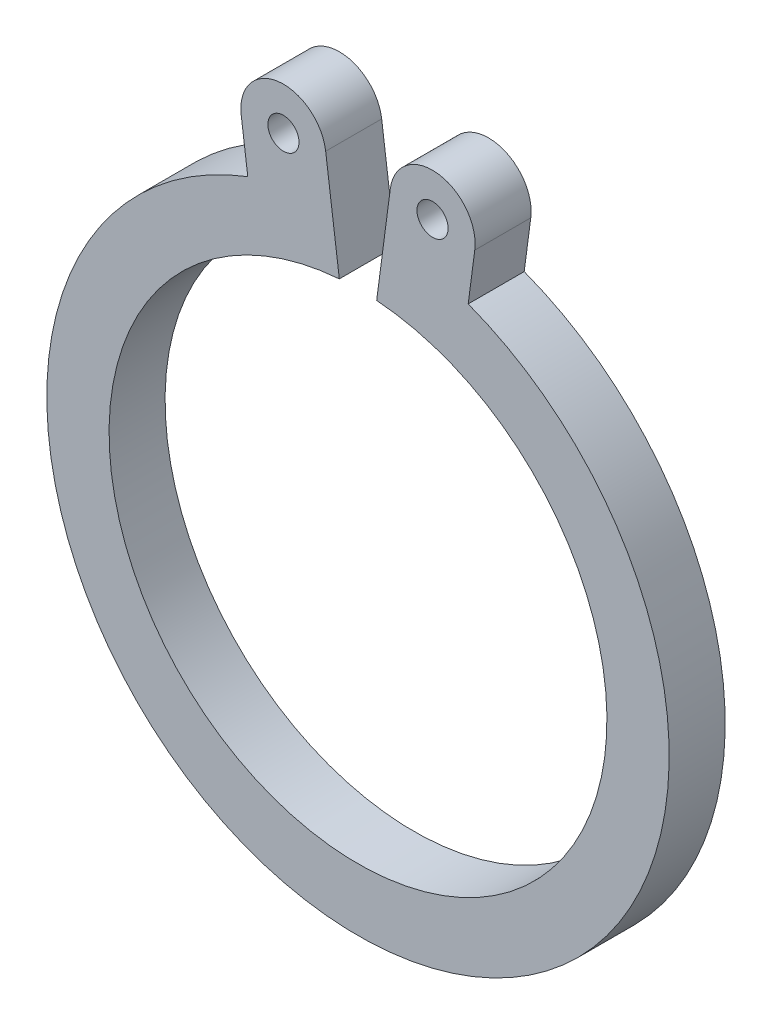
ISO-10303-21;
HEADER;
FILE_DESCRIPTION(('STEP AP214'),'2;1');
FILE_NAME('part.step','',(''),(''),'','','');
FILE_SCHEMA(('AUTOMOTIVE_DESIGN { 1 0 10303 214 1 1 1 1 }'));
ENDSEC;
DATA;
#1=APPLICATION_CONTEXT('core data for automotive mechanical design processes');
#2=APPLICATION_PROTOCOL_DEFINITION('international standard','automotive_design',2000,#1);
#3=PRODUCT_CONTEXT('',#1,'mechanical');
#4=PRODUCT('Part','Part','',(#3));
#5=PRODUCT_RELATED_PRODUCT_CATEGORY('part','',(#4));
#6=PRODUCT_DEFINITION_FORMATION('','',#4);
#7=PRODUCT_DEFINITION_CONTEXT('part definition',#1,'design');
#8=PRODUCT_DEFINITION('design','',#6,#7);
#9=PRODUCT_DEFINITION_SHAPE('','',#8);
#10=(LENGTH_UNIT() NAMED_UNIT(*) SI_UNIT(.MILLI.,.METRE.));
#11=(NAMED_UNIT(*) PLANE_ANGLE_UNIT() SI_UNIT($,.RADIAN.));
#12=(NAMED_UNIT(*) SI_UNIT($,.STERADIAN.) SOLID_ANGLE_UNIT());
#13=UNCERTAINTY_MEASURE_WITH_UNIT(LENGTH_MEASURE(1.E-05),#10,'distance_accuracy_value','');
#14=(GEOMETRIC_REPRESENTATION_CONTEXT(3) GLOBAL_UNCERTAINTY_ASSIGNED_CONTEXT((#13)) GLOBAL_UNIT_ASSIGNED_CONTEXT((#10,
#11,#12)) REPRESENTATION_CONTEXT('',''));
#15=CARTESIAN_POINT('',(0.,0.,0.));
#16=DIRECTION('',(0.,0.,1.));
#17=DIRECTION('',(1.,0.,0.));
#18=AXIS2_PLACEMENT_3D('',#15,#16,#17);
#19=CARTESIAN_POINT('',(1.19779655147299,5.56614903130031,0.9));
#20=DIRECTION('',(0.,0.,1.));
#21=DIRECTION('',(1.,0.,0.));
#22=AXIS2_PLACEMENT_3D('',#19,#20,#21);
#23=PLANE('',#22);
#24=CARTESIAN_POINT('',(1.19779655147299,5.56614903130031,0.9));
#25=DIRECTION('',(0.,0.,1.));
#26=DIRECTION('',(1.,0.,0.));
#27=AXIS2_PLACEMENT_3D('',#24,#25,#26);
#28=CIRCLE('',#27,0.25);
#29=CARTESIAN_POINT('',(1.44779655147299,5.56614903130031,0.9));
#30=VERTEX_POINT('',#29);
#31=EDGE_CURVE('E103',#30,#30,#28,.T.);
#32=ORIENTED_EDGE('',*,*,#31,.F.);
#33=EDGE_LOOP('',(#32));
#34=FACE_BOUND('',#33,.T.);
#35=CARTESIAN_POINT('',(1.19779655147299,5.56614903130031,0.9));
#36=DIRECTION('',(0.,0.,1.));
#37=DIRECTION('',(1.,0.,0.));
#38=AXIS2_PLACEMENT_3D('',#35,#36,#37);
#39=CIRCLE('',#38,0.68422181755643);
#40=CARTESIAN_POINT('',(1.87616475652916,5.47684016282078,0.9));
#41=VERTEX_POINT('',#40);
#42=CARTESIAN_POINT('',(0.519428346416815,5.65545789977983,0.9));
#43=VERTEX_POINT('',#42);
#44=EDGE_CURVE('E126',#41,#43,#39,.T.);
#45=ORIENTED_EDGE('',*,*,#44,.T.);
#46=DIRECTION('',(-0.130526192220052,-0.99144486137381,0.));
#47=VECTOR('',#46,1.);
#48=CARTESIAN_POINT('',(0.519428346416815,5.65545789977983,0.9));
#49=LINE('',#48,#47);
#50=CARTESIAN_POINT('',(0.3,3.98873413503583,0.9));
#51=VERTEX_POINT('',#50);
#52=EDGE_CURVE('E95',#43,#51,#49,.T.);
#53=ORIENTED_EDGE('',*,*,#52,.T.);
#54=CARTESIAN_POINT('',(0.,0.,0.9));
#55=DIRECTION('',(0.,0.,1.));
#56=DIRECTION('',(1.,0.,0.));
#57=AXIS2_PLACEMENT_3D('',#54,#55,#56);
#58=CIRCLE('',#57,4.);
#59=CARTESIAN_POINT('',(-0.3,3.98873413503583,0.9));
#60=VERTEX_POINT('',#59);
#61=EDGE_CURVE('E129',#60,#51,#58,.T.);
#62=ORIENTED_EDGE('',*,*,#61,.F.);
#63=DIRECTION('',(0.130526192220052,-0.99144486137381,0.));
#64=VECTOR('',#63,1.);
#65=CARTESIAN_POINT('',(-0.519428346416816,5.65545789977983,0.9));
#66=LINE('',#65,#64);
#67=CARTESIAN_POINT('',(-0.519428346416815,5.65545789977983,0.9));
#68=VERTEX_POINT('',#67);
#69=EDGE_CURVE('E132',#68,#60,#66,.T.);
#70=ORIENTED_EDGE('',*,*,#69,.F.);
#71=CARTESIAN_POINT('',(-1.19779655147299,5.56614903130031,0.9));
#72=DIRECTION('',(0.,0.,1.));
#73=DIRECTION('',(1.,0.,0.));
#74=AXIS2_PLACEMENT_3D('',#71,#72,#73);
#75=CIRCLE('',#74,0.68422181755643);
#76=CARTESIAN_POINT('',(-1.87616475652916,5.47684016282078,0.9));
#77=VERTEX_POINT('',#76);
#78=EDGE_CURVE('E135',#68,#77,#75,.T.);
#79=ORIENTED_EDGE('',*,*,#78,.T.);
#80=DIRECTION('',(-0.130526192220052,0.99144486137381,0.));
#81=VECTOR('',#80,1.);
#82=CARTESIAN_POINT('',(-1.77072586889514,4.67595229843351,0.9));
#83=LINE('',#82,#81);
#84=CARTESIAN_POINT('',(-1.77072586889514,4.67595229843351,0.9));
#85=VERTEX_POINT('',#84);
#86=EDGE_CURVE('E138',#85,#77,#83,.T.);
#87=ORIENTED_EDGE('',*,*,#86,.F.);
#88=CARTESIAN_POINT('',(0.,0.,0.9));
#89=DIRECTION('',(0.,0.,1.));
#90=DIRECTION('',(1.,0.,0.));
#91=AXIS2_PLACEMENT_3D('',#88,#89,#90);
#92=CIRCLE('',#91,5.00000000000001);
#93=CARTESIAN_POINT('',(1.77072586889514,4.67595229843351,0.9));
#94=VERTEX_POINT('',#93);
#95=EDGE_CURVE('E141',#85,#94,#92,.T.);
#96=ORIENTED_EDGE('',*,*,#95,.T.);
#97=DIRECTION('',(0.130526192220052,0.99144486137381,0.));
#98=VECTOR('',#97,1.);
#99=CARTESIAN_POINT('',(1.77072586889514,4.67595229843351,0.9));
#100=LINE('',#99,#98);
#101=EDGE_CURVE('E143',#94,#41,#100,.T.);
#102=ORIENTED_EDGE('',*,*,#101,.T.);
#103=EDGE_LOOP('',(#45,#53,#62,#70,#79,#87,#96,#102));
#104=FACE_BOUND('',#103,.T.);
#105=CARTESIAN_POINT('',(-1.19779655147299,5.56614903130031,0.9));
#106=DIRECTION('',(0.,0.,1.));
#107=DIRECTION('',(1.,0.,0.));
#108=AXIS2_PLACEMENT_3D('',#105,#106,#107);
#109=CIRCLE('',#108,0.25);
#110=CARTESIAN_POINT('',(-0.947796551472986,5.56614903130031,0.9));
#111=VERTEX_POINT('',#110);
#112=EDGE_CURVE('E232',#111,#111,#109,.T.);
#113=ORIENTED_EDGE('',*,*,#112,.F.);
#114=EDGE_LOOP('',(#113));
#115=FACE_BOUND('',#114,.T.);
#116=ADVANCED_FACE('F24',(#34,#104,#115),#23,.T.);
#117=CARTESIAN_POINT('',(1.19779655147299,5.56614903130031,0.));
#118=DIRECTION('',(0.,0.,1.));
#119=DIRECTION('',(1.,0.,0.));
#120=AXIS2_PLACEMENT_3D('',#117,#118,#119);
#121=PLANE('',#120);
#122=CARTESIAN_POINT('',(1.19779655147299,5.56614903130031,0.));
#123=DIRECTION('',(0.,0.,1.));
#124=DIRECTION('',(1.,0.,0.));
#125=AXIS2_PLACEMENT_3D('',#122,#123,#124);
#126=CIRCLE('',#125,0.25);
#127=CARTESIAN_POINT('',(1.44779655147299,5.56614903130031,0.));
#128=VERTEX_POINT('',#127);
#129=EDGE_CURVE('E237',#128,#128,#126,.T.);
#130=ORIENTED_EDGE('',*,*,#129,.T.);
#131=EDGE_LOOP('',(#130));
#132=FACE_BOUND('',#131,.T.);
#133=CARTESIAN_POINT('',(1.19779655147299,5.56614903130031,0.));
#134=DIRECTION('',(0.,0.,1.));
#135=DIRECTION('',(1.,0.,0.));
#136=AXIS2_PLACEMENT_3D('',#133,#134,#135);
#137=CIRCLE('',#136,0.68422181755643);
#138=CARTESIAN_POINT('',(1.87616475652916,5.47684016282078,0.));
#139=VERTEX_POINT('',#138);
#140=CARTESIAN_POINT('',(0.519428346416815,5.65545789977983,0.));
#141=VERTEX_POINT('',#140);
#142=EDGE_CURVE('E99',#139,#141,#137,.T.);
#143=ORIENTED_EDGE('',*,*,#142,.F.);
#144=DIRECTION('',(0.130526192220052,0.99144486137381,0.));
#145=VECTOR('',#144,1.);
#146=CARTESIAN_POINT('',(1.77072586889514,4.67595229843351,0.));
#147=LINE('',#146,#145);
#148=CARTESIAN_POINT('',(1.77072586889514,4.67595229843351,0.));
#149=VERTEX_POINT('',#148);
#150=EDGE_CURVE('E124',#149,#139,#147,.T.);
#151=ORIENTED_EDGE('',*,*,#150,.F.);
#152=CARTESIAN_POINT('',(0.,0.,0.));
#153=DIRECTION('',(0.,0.,1.));
#154=DIRECTION('',(1.,0.,0.));
#155=AXIS2_PLACEMENT_3D('',#152,#153,#154);
#156=CIRCLE('',#155,5.00000000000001);
#157=CARTESIAN_POINT('',(-1.77072586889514,4.67595229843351,0.));
#158=VERTEX_POINT('',#157);
#159=EDGE_CURVE('E122',#158,#149,#156,.T.);
#160=ORIENTED_EDGE('',*,*,#159,.F.);
#161=DIRECTION('',(-0.130526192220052,0.99144486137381,0.));
#162=VECTOR('',#161,1.);
#163=CARTESIAN_POINT('',(-1.77072586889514,4.67595229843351,0.));
#164=LINE('',#163,#162);
#165=CARTESIAN_POINT('',(-1.87616475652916,5.47684016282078,0.));
#166=VERTEX_POINT('',#165);
#167=EDGE_CURVE('E119',#158,#166,#164,.T.);
#168=ORIENTED_EDGE('',*,*,#167,.T.);
#169=CARTESIAN_POINT('',(-1.19779655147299,5.56614903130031,0.));
#170=DIRECTION('',(0.,0.,1.));
#171=DIRECTION('',(1.,0.,0.));
#172=AXIS2_PLACEMENT_3D('',#169,#170,#171);
#173=CIRCLE('',#172,0.68422181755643);
#174=CARTESIAN_POINT('',(-0.519428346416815,5.65545789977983,0.));
#175=VERTEX_POINT('',#174);
#176=EDGE_CURVE('E116',#175,#166,#173,.T.);
#177=ORIENTED_EDGE('',*,*,#176,.F.);
#178=DIRECTION('',(0.130526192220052,-0.99144486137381,0.));
#179=VECTOR('',#178,1.);
#180=CARTESIAN_POINT('',(-0.519428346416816,5.65545789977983,0.));
#181=LINE('',#180,#179);
#182=CARTESIAN_POINT('',(-0.3,3.98873413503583,0.));
#183=VERTEX_POINT('',#182);
#184=EDGE_CURVE('E111',#175,#183,#181,.T.);
#185=ORIENTED_EDGE('',*,*,#184,.T.);
#186=CARTESIAN_POINT('',(0.,0.,0.));
#187=DIRECTION('',(0.,0.,1.));
#188=DIRECTION('',(1.,0.,0.));
#189=AXIS2_PLACEMENT_3D('',#186,#187,#188);
#190=CIRCLE('',#189,4.);
#191=CARTESIAN_POINT('',(0.3,3.98873413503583,0.));
#192=VERTEX_POINT('',#191);
#193=EDGE_CURVE('E109',#183,#192,#190,.T.);
#194=ORIENTED_EDGE('',*,*,#193,.T.);
#195=DIRECTION('',(-0.130526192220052,-0.99144486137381,0.));
#196=VECTOR('',#195,1.);
#197=CARTESIAN_POINT('',(0.519428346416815,5.65545789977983,0.));
#198=LINE('',#197,#196);
#199=EDGE_CURVE('E92',#141,#192,#198,.T.);
#200=ORIENTED_EDGE('',*,*,#199,.F.);
#201=EDGE_LOOP('',(#143,#151,#160,#168,#177,#185,#194,#200));
#202=FACE_BOUND('',#201,.T.);
#203=CARTESIAN_POINT('',(-1.19779655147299,5.56614903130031,0.));
#204=DIRECTION('',(0.,0.,1.));
#205=DIRECTION('',(1.,0.,0.));
#206=AXIS2_PLACEMENT_3D('',#203,#204,#205);
#207=CIRCLE('',#206,0.25);
#208=CARTESIAN_POINT('',(-0.947796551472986,5.56614903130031,0.));
#209=VERTEX_POINT('',#208);
#210=EDGE_CURVE('E235',#209,#209,#207,.T.);
#211=ORIENTED_EDGE('',*,*,#210,.T.);
#212=EDGE_LOOP('',(#211));
#213=FACE_BOUND('',#212,.T.);
#214=ADVANCED_FACE('F105',(#132,#202,#213),#121,.F.);
#215=CARTESIAN_POINT('',(1.19779655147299,5.56614903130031,0.9));
#216=DIRECTION('',(0.,0.,-1.));
#217=DIRECTION('',(-1.,0.,0.));
#218=AXIS2_PLACEMENT_3D('',#215,#216,#217);
#219=CYLINDRICAL_SURFACE('',#218,0.68422181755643);
#220=DIRECTION('',(0.,0.,-1.));
#221=VECTOR('',#220,1.);
#222=CARTESIAN_POINT('',(0.519428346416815,5.65545789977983,0.9));
#223=LINE('',#222,#221);
#224=EDGE_CURVE('E11',#43,#141,#223,.T.);
#225=ORIENTED_EDGE('',*,*,#224,.F.);
#226=ORIENTED_EDGE('',*,*,#44,.F.);
#227=DIRECTION('',(0.,0.,-1.));
#228=VECTOR('',#227,1.);
#229=CARTESIAN_POINT('',(1.87616475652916,5.47684016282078,0.9));
#230=LINE('',#229,#228);
#231=EDGE_CURVE('E39',#41,#139,#230,.T.);
#232=ORIENTED_EDGE('',*,*,#231,.T.);
#233=ORIENTED_EDGE('',*,*,#142,.T.);
#234=EDGE_LOOP('',(#225,#226,#232,#233));
#235=FACE_BOUND('',#234,.T.);
#236=ADVANCED_FACE('F100',(#235),#219,.T.);
#237=CARTESIAN_POINT('',(0.519428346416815,5.65545789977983,0.9));
#238=DIRECTION('',(0.99144486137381,-0.130526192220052,0.));
#239=DIRECTION('',(0.130526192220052,0.99144486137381,0.));
#240=AXIS2_PLACEMENT_3D('',#237,#238,#239);
#241=PLANE('',#240);
#242=DIRECTION('',(0.,0.,-1.));
#243=VECTOR('',#242,1.);
#244=CARTESIAN_POINT('',(0.3,3.98873413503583,0.9));
#245=LINE('',#244,#243);
#246=EDGE_CURVE('E32',#51,#192,#245,.T.);
#247=ORIENTED_EDGE('',*,*,#246,.F.);
#248=ORIENTED_EDGE('',*,*,#52,.F.);
#249=ORIENTED_EDGE('',*,*,#224,.T.);
#250=ORIENTED_EDGE('',*,*,#199,.T.);
#251=EDGE_LOOP('',(#247,#248,#249,#250));
#252=FACE_BOUND('',#251,.T.);
#253=ADVANCED_FACE('F26',(#252),#241,.F.);
#254=CARTESIAN_POINT('',(0.,0.,0.9));
#255=DIRECTION('',(0.,0.,-1.));
#256=DIRECTION('',(-1.,0.,0.));
#257=AXIS2_PLACEMENT_3D('',#254,#255,#256);
#258=CYLINDRICAL_SURFACE('',#257,4.);
#259=DIRECTION('',(0.,0.,-1.));
#260=VECTOR('',#259,1.);
#261=CARTESIAN_POINT('',(-0.3,3.98873413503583,0.9));
#262=LINE('',#261,#260);
#263=EDGE_CURVE('E154',#60,#183,#262,.T.);
#264=ORIENTED_EDGE('',*,*,#263,.F.);
#265=ORIENTED_EDGE('',*,*,#61,.T.);
#266=ORIENTED_EDGE('',*,*,#246,.T.);
#267=ORIENTED_EDGE('',*,*,#193,.F.);
#268=EDGE_LOOP('',(#264,#265,#266,#267));
#269=FACE_BOUND('',#268,.T.);
#270=ADVANCED_FACE('F156',(#269),#258,.F.);
#271=CARTESIAN_POINT('',(-0.519428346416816,5.65545789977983,0.9));
#272=DIRECTION('',(0.99144486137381,0.130526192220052,0.));
#273=DIRECTION('',(-0.130526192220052,0.99144486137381,0.));
#274=AXIS2_PLACEMENT_3D('',#271,#272,#273);
#275=PLANE('',#274);
#276=DIRECTION('',(0.,0.,-1.));
#277=VECTOR('',#276,1.);
#278=CARTESIAN_POINT('',(-0.519428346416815,5.65545789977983,0.9));
#279=LINE('',#278,#277);
#280=EDGE_CURVE('E152',#68,#175,#279,.T.);
#281=ORIENTED_EDGE('',*,*,#280,.F.);
#282=ORIENTED_EDGE('',*,*,#69,.T.);
#283=ORIENTED_EDGE('',*,*,#263,.T.);
#284=ORIENTED_EDGE('',*,*,#184,.F.);
#285=EDGE_LOOP('',(#281,#282,#283,#284));
#286=FACE_BOUND('',#285,.T.);
#287=ADVANCED_FACE('F174',(#286),#275,.T.);
#288=CARTESIAN_POINT('',(-1.19779655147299,5.56614903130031,0.9));
#289=DIRECTION('',(0.,0.,-1.));
#290=DIRECTION('',(-1.,0.,0.));
#291=AXIS2_PLACEMENT_3D('',#288,#289,#290);
#292=CYLINDRICAL_SURFACE('',#291,0.68422181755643);
#293=DIRECTION('',(0.,0.,-1.));
#294=VECTOR('',#293,1.);
#295=CARTESIAN_POINT('',(-1.87616475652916,5.47684016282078,0.9));
#296=LINE('',#295,#294);
#297=EDGE_CURVE('E150',#77,#166,#296,.T.);
#298=ORIENTED_EDGE('',*,*,#297,.F.);
#299=ORIENTED_EDGE('',*,*,#78,.F.);
#300=ORIENTED_EDGE('',*,*,#280,.T.);
#301=ORIENTED_EDGE('',*,*,#176,.T.);
#302=EDGE_LOOP('',(#298,#299,#300,#301));
#303=FACE_BOUND('',#302,.T.);
#304=ADVANCED_FACE('F171',(#303),#292,.T.);
#305=CARTESIAN_POINT('',(-1.77072586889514,4.67595229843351,0.9));
#306=DIRECTION('',(-0.99144486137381,-0.130526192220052,0.));
#307=DIRECTION('',(0.130526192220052,-0.99144486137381,0.));
#308=AXIS2_PLACEMENT_3D('',#305,#306,#307);
#309=PLANE('',#308);
#310=DIRECTION('',(0.,0.,-1.));
#311=VECTOR('',#310,1.);
#312=CARTESIAN_POINT('',(-1.77072586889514,4.67595229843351,0.9));
#313=LINE('',#312,#311);
#314=EDGE_CURVE('E148',#85,#158,#313,.T.);
#315=ORIENTED_EDGE('',*,*,#314,.F.);
#316=ORIENTED_EDGE('',*,*,#86,.T.);
#317=ORIENTED_EDGE('',*,*,#297,.T.);
#318=ORIENTED_EDGE('',*,*,#167,.F.);
#319=EDGE_LOOP('',(#315,#316,#317,#318));
#320=FACE_BOUND('',#319,.T.);
#321=ADVANCED_FACE('F168',(#320),#309,.T.);
#322=CARTESIAN_POINT('',(0.,0.,0.9));
#323=DIRECTION('',(0.,0.,-1.));
#324=DIRECTION('',(-1.,0.,0.));
#325=AXIS2_PLACEMENT_3D('',#322,#323,#324);
#326=CYLINDRICAL_SURFACE('',#325,5.00000000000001);
#327=DIRECTION('',(0.,0.,-1.));
#328=VECTOR('',#327,1.);
#329=CARTESIAN_POINT('',(1.77072586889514,4.67595229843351,0.9));
#330=LINE('',#329,#328);
#331=EDGE_CURVE('E47',#94,#149,#330,.T.);
#332=ORIENTED_EDGE('',*,*,#331,.F.);
#333=ORIENTED_EDGE('',*,*,#95,.F.);
#334=ORIENTED_EDGE('',*,*,#314,.T.);
#335=ORIENTED_EDGE('',*,*,#159,.T.);
#336=EDGE_LOOP('',(#332,#333,#334,#335));
#337=FACE_BOUND('',#336,.T.);
#338=ADVANCED_FACE('F164',(#337),#326,.T.);
#339=CARTESIAN_POINT('',(1.77072586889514,4.67595229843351,0.9));
#340=DIRECTION('',(-0.99144486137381,0.130526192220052,0.));
#341=DIRECTION('',(-0.130526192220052,-0.99144486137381,0.));
#342=AXIS2_PLACEMENT_3D('',#339,#340,#341);
#343=PLANE('',#342);
#344=ORIENTED_EDGE('',*,*,#101,.F.);
#345=ORIENTED_EDGE('',*,*,#331,.T.);
#346=ORIENTED_EDGE('',*,*,#150,.T.);
#347=ORIENTED_EDGE('',*,*,#231,.F.);
#348=EDGE_LOOP('',(#344,#345,#346,#347));
#349=FACE_BOUND('',#348,.T.);
#350=ADVANCED_FACE('F162',(#349),#343,.F.);
#351=CARTESIAN_POINT('',(1.19779655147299,5.56614903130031,0.9));
#352=DIRECTION('',(0.,0.,-1.));
#353=DIRECTION('',(-1.,0.,0.));
#354=AXIS2_PLACEMENT_3D('',#351,#352,#353);
#355=CYLINDRICAL_SURFACE('',#354,0.25);
#356=ORIENTED_EDGE('',*,*,#31,.T.);
#357=EDGE_LOOP('',(#356));
#358=FACE_BOUND('',#357,.T.);
#359=ORIENTED_EDGE('',*,*,#129,.F.);
#360=EDGE_LOOP('',(#359));
#361=FACE_BOUND('',#360,.T.);
#362=ADVANCED_FACE('F197',(#358,#361),#355,.F.);
#363=CARTESIAN_POINT('',(-1.19779655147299,5.56614903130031,0.9));
#364=DIRECTION('',(0.,0.,-1.));
#365=DIRECTION('',(-1.,0.,0.));
#366=AXIS2_PLACEMENT_3D('',#363,#364,#365);
#367=CYLINDRICAL_SURFACE('',#366,0.25);
#368=ORIENTED_EDGE('',*,*,#112,.T.);
#369=EDGE_LOOP('',(#368));
#370=FACE_BOUND('',#369,.T.);
#371=ORIENTED_EDGE('',*,*,#210,.F.);
#372=EDGE_LOOP('',(#371));
#373=FACE_BOUND('',#372,.T.);
#374=ADVANCED_FACE('F219',(#370,#373),#367,.F.);
#375=CLOSED_SHELL('',(#116,#214,#236,#253,#270,#287,#304,#321,#338,#350,#362,#374));
#376=MANIFOLD_SOLID_BREP('B2',#375);
#377=ADVANCED_BREP_SHAPE_REPRESENTATION('',(#18,#376),#14);
#378=SHAPE_DEFINITION_REPRESENTATION(#9,#377);
ENDSEC;
END-ISO-10303-21;
